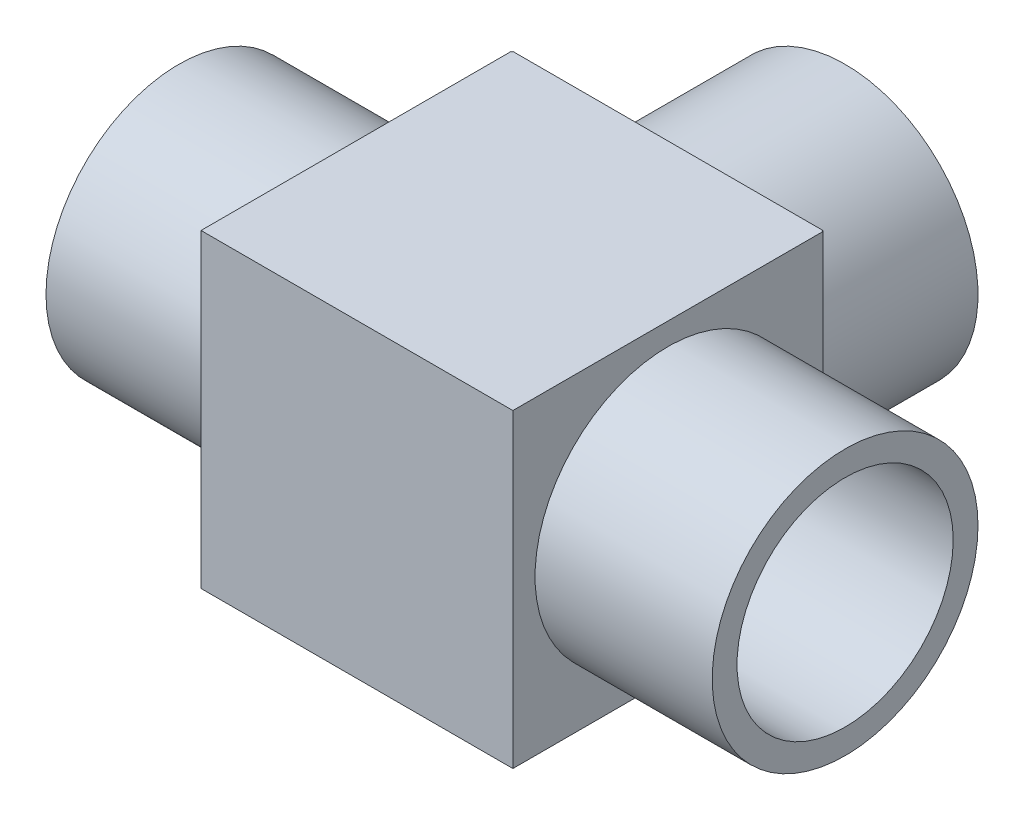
ISO-10303-21;
HEADER;
FILE_DESCRIPTION(('STEP AP214'),'2;1');
FILE_NAME('part.step','',(''),(''),'','','');
FILE_SCHEMA(('AUTOMOTIVE_DESIGN { 1 0 10303 214 1 1 1 1 }'));
ENDSEC;
DATA;
#1=APPLICATION_CONTEXT('core data for automotive mechanical design processes');
#2=APPLICATION_PROTOCOL_DEFINITION('international standard','automotive_design',2000,#1);
#3=PRODUCT_CONTEXT('',#1,'mechanical');
#4=PRODUCT('Part','Part','',(#3));
#5=PRODUCT_RELATED_PRODUCT_CATEGORY('part','',(#4));
#6=PRODUCT_DEFINITION_FORMATION('','',#4);
#7=PRODUCT_DEFINITION_CONTEXT('part definition',#1,'design');
#8=PRODUCT_DEFINITION('design','',#6,#7);
#9=PRODUCT_DEFINITION_SHAPE('','',#8);
#10=(LENGTH_UNIT() NAMED_UNIT(*) SI_UNIT(.MILLI.,.METRE.));
#11=(NAMED_UNIT(*) PLANE_ANGLE_UNIT() SI_UNIT($,.RADIAN.));
#12=(NAMED_UNIT(*) SI_UNIT($,.STERADIAN.) SOLID_ANGLE_UNIT());
#13=UNCERTAINTY_MEASURE_WITH_UNIT(LENGTH_MEASURE(1.E-05),#10,'distance_accuracy_value','');
#14=(GEOMETRIC_REPRESENTATION_CONTEXT(3) GLOBAL_UNCERTAINTY_ASSIGNED_CONTEXT((#13)) GLOBAL_UNIT_ASSIGNED_CONTEXT((#10,
#11,#12)) REPRESENTATION_CONTEXT('',''));
#15=CARTESIAN_POINT('',(0.,0.,0.));
#16=DIRECTION('',(0.,0.,1.));
#17=DIRECTION('',(1.,0.,0.));
#18=AXIS2_PLACEMENT_3D('',#15,#16,#17);
#19=CARTESIAN_POINT('',(6.38175,5.55625,0.));
#20=DIRECTION('',(-1.,0.,0.));
#21=DIRECTION('',(0.,-1.,0.));
#22=AXIS2_PLACEMENT_3D('',#19,#20,#21);
#23=PLANE('',#22);
#24=DIRECTION('',(0.,1.,0.));
#25=VECTOR('',#24,1.);
#26=CARTESIAN_POINT('',(6.38175,5.55625,-5.55625));
#27=LINE('',#26,#25);
#28=CARTESIAN_POINT('',(6.38175,5.55625,-5.55625));
#29=VERTEX_POINT('',#28);
#30=CARTESIAN_POINT('',(6.38175,-5.55625,-5.55625));
#31=VERTEX_POINT('',#30);
#32=EDGE_CURVE('E149',#29,#31,#27,.F.);
#33=ORIENTED_EDGE('',*,*,#32,.F.);
#34=DIRECTION('',(0.,0.,1.));
#35=VECTOR('',#34,1.);
#36=CARTESIAN_POINT('',(6.38175,5.55625,0.));
#37=LINE('',#36,#35);
#38=CARTESIAN_POINT('',(6.38175,5.55625,-5.588));
#39=VERTEX_POINT('',#38);
#40=EDGE_CURVE('E157',#29,#39,#37,.F.);
#41=ORIENTED_EDGE('',*,*,#40,.T.);
#42=DIRECTION('',(0.,1.,0.));
#43=VECTOR('',#42,1.);
#44=CARTESIAN_POINT('',(6.38175,0.,-5.588));
#45=LINE('',#44,#43);
#46=CARTESIAN_POINT('',(6.38175,-5.55625,-5.588));
#47=VERTEX_POINT('',#46);
#48=EDGE_CURVE('E154',#47,#39,#45,.T.);
#49=ORIENTED_EDGE('',*,*,#48,.F.);
#50=DIRECTION('',(0.,0.,1.));
#51=VECTOR('',#50,1.);
#52=CARTESIAN_POINT('',(6.38175,-5.55625,0.));
#53=LINE('',#52,#51);
#54=EDGE_CURVE('E159',#47,#31,#53,.T.);
#55=ORIENTED_EDGE('',*,*,#54,.T.);
#56=EDGE_LOOP('',(#33,#41,#49,#55));
#57=FACE_BOUND('',#56,.T.);
#58=ADVANCED_FACE('F16',(#57),#23,.T.);
#59=CARTESIAN_POINT('',(17.49425,-5.55625,0.));
#60=DIRECTION('',(1.,0.,0.));
#61=DIRECTION('',(0.,1.,0.));
#62=AXIS2_PLACEMENT_3D('',#59,#60,#61);
#63=PLANE('',#62);
#64=DIRECTION('',(0.,1.,0.));
#65=VECTOR('',#64,1.);
#66=CARTESIAN_POINT('',(17.49425,0.,-5.588));
#67=LINE('',#66,#65);
#68=CARTESIAN_POINT('',(17.49425,5.55625,-5.588));
#69=VERTEX_POINT('',#68);
#70=CARTESIAN_POINT('',(17.49425,-5.55625,-5.588));
#71=VERTEX_POINT('',#70);
#72=EDGE_CURVE('E152',#69,#71,#67,.F.);
#73=ORIENTED_EDGE('',*,*,#72,.F.);
#74=DIRECTION('',(0.,0.,1.));
#75=VECTOR('',#74,1.);
#76=CARTESIAN_POINT('',(17.49425,5.55625,5.55625));
#77=LINE('',#76,#75);
#78=CARTESIAN_POINT('',(17.49425,5.55625,-5.55625));
#79=VERTEX_POINT('',#78);
#80=EDGE_CURVE('E145',#79,#69,#77,.F.);
#81=ORIENTED_EDGE('',*,*,#80,.F.);
#82=DIRECTION('',(0.,1.,0.));
#83=VECTOR('',#82,1.);
#84=CARTESIAN_POINT('',(17.49425,5.55625,-5.55625));
#85=LINE('',#84,#83);
#86=CARTESIAN_POINT('',(17.49425,-5.55625,-5.55625));
#87=VERTEX_POINT('',#86);
#88=EDGE_CURVE('E130',#87,#79,#85,.T.);
#89=ORIENTED_EDGE('',*,*,#88,.F.);
#90=DIRECTION('',(0.,0.,1.));
#91=VECTOR('',#90,1.);
#92=CARTESIAN_POINT('',(17.49425,-5.55625,-5.55625));
#93=LINE('',#92,#91);
#94=EDGE_CURVE('E102',#71,#87,#93,.T.);
#95=ORIENTED_EDGE('',*,*,#94,.F.);
#96=EDGE_LOOP('',(#73,#81,#89,#95));
#97=FACE_BOUND('',#96,.T.);
#98=ADVANCED_FACE('F240',(#97),#63,.T.);
#99=CARTESIAN_POINT('',(14.716125,0.,-5.588));
#100=DIRECTION('',(0.,0.,-1.));
#101=DIRECTION('',(-1.,0.,0.));
#102=AXIS2_PLACEMENT_3D('',#99,#100,#101);
#103=PLANE('',#102);
#104=DIRECTION('',(1.,0.,0.));
#105=VECTOR('',#104,1.);
#106=CARTESIAN_POINT('',(6.35,5.55625,-5.588));
#107=LINE('',#106,#105);
#108=EDGE_CURVE('E142',#69,#39,#107,.F.);
#109=ORIENTED_EDGE('',*,*,#108,.F.);
#110=ORIENTED_EDGE('',*,*,#72,.T.);
#111=DIRECTION('',(1.,0.,0.));
#112=VECTOR('',#111,1.);
#113=CARTESIAN_POINT('',(6.35,-5.55625,-5.588));
#114=LINE('',#113,#112);
#115=EDGE_CURVE('E138',#47,#71,#114,.T.);
#116=ORIENTED_EDGE('',*,*,#115,.F.);
#117=ORIENTED_EDGE('',*,*,#48,.T.);
#118=EDGE_LOOP('',(#109,#110,#116,#117));
#119=FACE_BOUND('',#118,.T.);
#120=CARTESIAN_POINT('',(11.938,0.,-5.588));
#121=DIRECTION('',(0.,0.,-1.));
#122=DIRECTION('',(-1.,0.,0.));
#123=AXIS2_PLACEMENT_3D('',#120,#121,#122);
#124=CIRCLE('',#123,4.7625);
#125=CARTESIAN_POINT('',(7.1755,0.,-5.588));
#126=VERTEX_POINT('',#125);
#127=EDGE_CURVE('E19',#126,#126,#124,.T.);
#128=ORIENTED_EDGE('',*,*,#127,.F.);
#129=EDGE_LOOP('',(#128));
#130=FACE_BOUND('',#129,.T.);
#131=ADVANCED_FACE('F237',(#119,#130),#103,.T.);
#132=CARTESIAN_POINT('',(6.35,5.55625,-5.55625));
#133=DIRECTION('',(0.,0.,-1.));
#134=DIRECTION('',(-1.,0.,0.));
#135=AXIS2_PLACEMENT_3D('',#132,#133,#134);
#136=PLANE('',#135);
#137=DIRECTION('',(0.,1.,0.));
#138=VECTOR('',#137,1.);
#139=CARTESIAN_POINT('',(6.35,0.,-5.55625));
#140=LINE('',#139,#138);
#141=CARTESIAN_POINT('',(6.35,5.55625,-5.55625));
#142=VERTEX_POINT('',#141);
#143=CARTESIAN_POINT('',(6.35,-5.55625,-5.55625));
#144=VERTEX_POINT('',#143);
#145=EDGE_CURVE('E117',#142,#144,#140,.F.);
#146=ORIENTED_EDGE('',*,*,#145,.F.);
#147=DIRECTION('',(1.,0.,0.));
#148=VECTOR('',#147,1.);
#149=CARTESIAN_POINT('',(6.35,5.55625,-5.55625));
#150=LINE('',#149,#148);
#151=EDGE_CURVE('E147',#29,#142,#150,.F.);
#152=ORIENTED_EDGE('',*,*,#151,.F.);
#153=ORIENTED_EDGE('',*,*,#32,.T.);
#154=DIRECTION('',(1.,0.,0.));
#155=VECTOR('',#154,1.);
#156=CARTESIAN_POINT('',(6.35,-5.55625,-5.55625));
#157=LINE('',#156,#155);
#158=EDGE_CURVE('E132',#144,#31,#157,.T.);
#159=ORIENTED_EDGE('',*,*,#158,.F.);
#160=EDGE_LOOP('',(#146,#152,#153,#159));
#161=FACE_BOUND('',#160,.T.);
#162=ADVANCED_FACE('F239',(#161),#136,.T.);
#163=CARTESIAN_POINT('',(6.35,5.55625,5.55625));
#164=DIRECTION('',(0.,1.,0.));
#165=DIRECTION('',(0.,0.,1.));
#166=AXIS2_PLACEMENT_3D('',#163,#164,#165);
#167=PLANE('',#166);
#168=ORIENTED_EDGE('',*,*,#108,.T.);
#169=ORIENTED_EDGE('',*,*,#40,.F.);
#170=ORIENTED_EDGE('',*,*,#151,.T.);
#171=DIRECTION('',(0.,0.,1.));
#172=VECTOR('',#171,1.);
#173=CARTESIAN_POINT('',(6.35,5.55625,-2.778125));
#174=LINE('',#173,#172);
#175=CARTESIAN_POINT('',(6.35,5.55625,5.55625));
#176=VERTEX_POINT('',#175);
#177=EDGE_CURVE('E120',#176,#142,#174,.F.);
#178=ORIENTED_EDGE('',*,*,#177,.F.);
#179=DIRECTION('',(1.,0.,0.));
#180=VECTOR('',#179,1.);
#181=CARTESIAN_POINT('',(6.35,5.55625,5.55625));
#182=LINE('',#181,#180);
#183=CARTESIAN_POINT('',(17.526,5.55625,5.55625));
#184=VERTEX_POINT('',#183);
#185=EDGE_CURVE('E140',#184,#176,#182,.F.);
#186=ORIENTED_EDGE('',*,*,#185,.F.);
#187=DIRECTION('',(0.,0.,1.));
#188=VECTOR('',#187,1.);
#189=CARTESIAN_POINT('',(17.526,5.55625,-2.778125));
#190=LINE('',#189,#188);
#191=CARTESIAN_POINT('',(17.526,5.55625,-5.55625));
#192=VERTEX_POINT('',#191);
#193=EDGE_CURVE('E115',#192,#184,#190,.T.);
#194=ORIENTED_EDGE('',*,*,#193,.F.);
#195=DIRECTION('',(-1.,0.,0.));
#196=VECTOR('',#195,1.);
#197=CARTESIAN_POINT('',(6.35,5.55625,-5.55625));
#198=LINE('',#197,#196);
#199=EDGE_CURVE('E105',#79,#192,#198,.F.);
#200=ORIENTED_EDGE('',*,*,#199,.F.);
#201=ORIENTED_EDGE('',*,*,#80,.T.);
#202=EDGE_LOOP('',(#168,#169,#170,#178,#186,#194,#200,#201));
#203=FACE_BOUND('',#202,.T.);
#204=ADVANCED_FACE('F247',(#203),#167,.T.);
#205=CARTESIAN_POINT('',(6.35,-5.55625,5.55625));
#206=DIRECTION('',(0.,0.,1.));
#207=DIRECTION('',(0.,-1.,0.));
#208=AXIS2_PLACEMENT_3D('',#205,#206,#207);
#209=PLANE('',#208);
#210=DIRECTION('',(0.,1.,0.));
#211=VECTOR('',#210,1.);
#212=CARTESIAN_POINT('',(17.526,0.,5.55625));
#213=LINE('',#212,#211);
#214=CARTESIAN_POINT('',(17.526,-5.55625,5.55625));
#215=VERTEX_POINT('',#214);
#216=EDGE_CURVE('E92',#184,#215,#213,.F.);
#217=ORIENTED_EDGE('',*,*,#216,.F.);
#218=ORIENTED_EDGE('',*,*,#185,.T.);
#219=DIRECTION('',(0.,1.,0.));
#220=VECTOR('',#219,1.);
#221=CARTESIAN_POINT('',(6.35,0.,5.55625));
#222=LINE('',#221,#220);
#223=CARTESIAN_POINT('',(6.35,-5.55625,5.55625));
#224=VERTEX_POINT('',#223);
#225=EDGE_CURVE('E123',#224,#176,#222,.T.);
#226=ORIENTED_EDGE('',*,*,#225,.F.);
#227=DIRECTION('',(1.,0.,0.));
#228=VECTOR('',#227,1.);
#229=CARTESIAN_POINT('',(6.35,-5.55625,5.55625));
#230=LINE('',#229,#228);
#231=EDGE_CURVE('E135',#215,#224,#230,.F.);
#232=ORIENTED_EDGE('',*,*,#231,.F.);
#233=EDGE_LOOP('',(#217,#218,#226,#232));
#234=FACE_BOUND('',#233,.T.);
#235=ADVANCED_FACE('F255',(#234),#209,.T.);
#236=CARTESIAN_POINT('',(6.35,-5.55625,-5.55625));
#237=DIRECTION('',(0.,-1.,0.));
#238=DIRECTION('',(1.,0.,0.));
#239=AXIS2_PLACEMENT_3D('',#236,#237,#238);
#240=PLANE('',#239);
#241=DIRECTION('',(0.,0.,1.));
#242=VECTOR('',#241,1.);
#243=CARTESIAN_POINT('',(6.35,-5.55625,-2.778125));
#244=LINE('',#243,#242);
#245=EDGE_CURVE('E126',#144,#224,#244,.T.);
#246=ORIENTED_EDGE('',*,*,#245,.F.);
#247=ORIENTED_EDGE('',*,*,#158,.T.);
#248=ORIENTED_EDGE('',*,*,#54,.F.);
#249=ORIENTED_EDGE('',*,*,#115,.T.);
#250=ORIENTED_EDGE('',*,*,#94,.T.);
#251=DIRECTION('',(-1.,0.,0.));
#252=VECTOR('',#251,1.);
#253=CARTESIAN_POINT('',(6.35,-5.55625,-5.55625));
#254=LINE('',#253,#252);
#255=CARTESIAN_POINT('',(17.526,-5.55625,-5.55625));
#256=VERTEX_POINT('',#255);
#257=EDGE_CURVE('E97',#256,#87,#254,.T.);
#258=ORIENTED_EDGE('',*,*,#257,.F.);
#259=DIRECTION('',(0.,0.,1.));
#260=VECTOR('',#259,1.);
#261=CARTESIAN_POINT('',(17.526,-5.55625,-2.778125));
#262=LINE('',#261,#260);
#263=EDGE_CURVE('E84',#215,#256,#262,.F.);
#264=ORIENTED_EDGE('',*,*,#263,.F.);
#265=ORIENTED_EDGE('',*,*,#231,.T.);
#266=EDGE_LOOP('',(#246,#247,#248,#249,#250,#258,#264,#265));
#267=FACE_BOUND('',#266,.T.);
#268=ADVANCED_FACE('F99',(#267),#240,.T.);
#269=CARTESIAN_POINT('',(6.35,5.55625,-5.55625));
#270=DIRECTION('',(0.,0.,-1.));
#271=DIRECTION('',(-1.,0.,0.));
#272=AXIS2_PLACEMENT_3D('',#269,#270,#271);
#273=PLANE('',#272);
#274=DIRECTION('',(0.,1.,0.));
#275=VECTOR('',#274,1.);
#276=CARTESIAN_POINT('',(17.526,0.,-5.55625));
#277=LINE('',#276,#275);
#278=EDGE_CURVE('E89',#256,#192,#277,.T.);
#279=ORIENTED_EDGE('',*,*,#278,.F.);
#280=ORIENTED_EDGE('',*,*,#257,.T.);
#281=ORIENTED_EDGE('',*,*,#88,.T.);
#282=ORIENTED_EDGE('',*,*,#199,.T.);
#283=EDGE_LOOP('',(#279,#280,#281,#282));
#284=FACE_BOUND('',#283,.T.);
#285=ADVANCED_FACE('F107',(#284),#273,.T.);
#286=CARTESIAN_POINT('',(11.938,0.,-8.763));
#287=DIRECTION('',(0.,0.,-1.));
#288=DIRECTION('',(-1.,0.,0.));
#289=AXIS2_PLACEMENT_3D('',#286,#287,#288);
#290=CYLINDRICAL_SURFACE('',#289,4.7625);
#291=CARTESIAN_POINT('',(11.938,0.,-11.938));
#292=DIRECTION('',(0.,0.,-1.));
#293=DIRECTION('',(-1.,0.,0.));
#294=AXIS2_PLACEMENT_3D('',#291,#292,#293);
#295=CIRCLE('',#294,4.7625);
#296=CARTESIAN_POINT('',(7.1755,0.,-11.938));
#297=VERTEX_POINT('',#296);
#298=EDGE_CURVE('E109',#297,#297,#295,.T.);
#299=ORIENTED_EDGE('',*,*,#298,.F.);
#300=EDGE_LOOP('',(#299));
#301=FACE_BOUND('',#300,.T.);
#302=ORIENTED_EDGE('',*,*,#127,.T.);
#303=EDGE_LOOP('',(#302));
#304=FACE_BOUND('',#303,.T.);
#305=ADVANCED_FACE('F185',(#301,#304),#290,.T.);
#306=CARTESIAN_POINT('',(6.35,0.,-2.778125));
#307=DIRECTION('',(-1.,0.,0.));
#308=DIRECTION('',(0.,0.,1.));
#309=AXIS2_PLACEMENT_3D('',#306,#307,#308);
#310=PLANE('',#309);
#311=ORIENTED_EDGE('',*,*,#177,.T.);
#312=ORIENTED_EDGE('',*,*,#145,.T.);
#313=ORIENTED_EDGE('',*,*,#245,.T.);
#314=ORIENTED_EDGE('',*,*,#225,.T.);
#315=EDGE_LOOP('',(#311,#312,#313,#314));
#316=FACE_BOUND('',#315,.T.);
#317=CARTESIAN_POINT('',(6.35,0.,0.));
#318=DIRECTION('',(-1.,0.,0.));
#319=DIRECTION('',(0.,0.,1.));
#320=AXIS2_PLACEMENT_3D('',#317,#318,#319);
#321=CIRCLE('',#320,4.7625);
#322=CARTESIAN_POINT('',(6.35,0.,4.7625));
#323=VERTEX_POINT('',#322);
#324=EDGE_CURVE('E112',#323,#323,#321,.T.);
#325=ORIENTED_EDGE('',*,*,#324,.F.);
#326=EDGE_LOOP('',(#325));
#327=FACE_BOUND('',#326,.T.);
#328=ADVANCED_FACE('F183',(#316,#327),#310,.T.);
#329=CARTESIAN_POINT('',(17.526,0.,-2.778125));
#330=DIRECTION('',(1.,0.,0.));
#331=DIRECTION('',(0.,1.,0.));
#332=AXIS2_PLACEMENT_3D('',#329,#330,#331);
#333=PLANE('',#332);
#334=ORIENTED_EDGE('',*,*,#263,.T.);
#335=ORIENTED_EDGE('',*,*,#278,.T.);
#336=ORIENTED_EDGE('',*,*,#193,.T.);
#337=ORIENTED_EDGE('',*,*,#216,.T.);
#338=EDGE_LOOP('',(#334,#335,#336,#337));
#339=FACE_BOUND('',#338,.T.);
#340=CARTESIAN_POINT('',(17.526,0.,0.));
#341=DIRECTION('',(1.,0.,0.));
#342=DIRECTION('',(0.,0.,-1.));
#343=AXIS2_PLACEMENT_3D('',#340,#341,#342);
#344=CIRCLE('',#343,4.7625);
#345=CARTESIAN_POINT('',(17.526,0.,-4.7625));
#346=VERTEX_POINT('',#345);
#347=EDGE_CURVE('E175',#346,#346,#344,.T.);
#348=ORIENTED_EDGE('',*,*,#347,.F.);
#349=EDGE_LOOP('',(#348));
#350=FACE_BOUND('',#349,.T.);
#351=ADVANCED_FACE('F86',(#339,#350),#333,.T.);
#352=CARTESIAN_POINT('',(14.31925,0.,-11.938));
#353=DIRECTION('',(0.,0.,-1.));
#354=DIRECTION('',(-1.,0.,0.));
#355=AXIS2_PLACEMENT_3D('',#352,#353,#354);
#356=PLANE('',#355);
#357=ORIENTED_EDGE('',*,*,#298,.T.);
#358=EDGE_LOOP('',(#357));
#359=FACE_BOUND('',#358,.T.);
#360=CARTESIAN_POINT('',(11.938,0.,-11.938));
#361=DIRECTION('',(0.,0.,1.));
#362=DIRECTION('',(1.,0.,0.));
#363=AXIS2_PLACEMENT_3D('',#360,#361,#362);
#364=CIRCLE('',#363,3.8735);
#365=CARTESIAN_POINT('',(15.8115,0.,-11.938));
#366=VERTEX_POINT('',#365);
#367=EDGE_CURVE('E172',#366,#366,#364,.T.);
#368=ORIENTED_EDGE('',*,*,#367,.T.);
#369=EDGE_LOOP('',(#368));
#370=FACE_BOUND('',#369,.T.);
#371=ADVANCED_FACE('F193',(#359,#370),#356,.T.);
#372=CARTESIAN_POINT('',(3.175,0.,0.));
#373=DIRECTION('',(-1.,0.,0.));
#374=DIRECTION('',(0.,0.,1.));
#375=AXIS2_PLACEMENT_3D('',#372,#373,#374);
#376=CYLINDRICAL_SURFACE('',#375,4.7625);
#377=CARTESIAN_POINT('',(0.,0.,0.));
#378=DIRECTION('',(-1.,0.,0.));
#379=DIRECTION('',(0.,0.,1.));
#380=AXIS2_PLACEMENT_3D('',#377,#378,#379);
#381=CIRCLE('',#380,4.7625);
#382=CARTESIAN_POINT('',(0.,0.,4.7625));
#383=VERTEX_POINT('',#382);
#384=EDGE_CURVE('E169',#383,#383,#381,.T.);
#385=ORIENTED_EDGE('',*,*,#384,.F.);
#386=EDGE_LOOP('',(#385));
#387=FACE_BOUND('',#386,.T.);
#388=ORIENTED_EDGE('',*,*,#324,.T.);
#389=EDGE_LOOP('',(#388));
#390=FACE_BOUND('',#389,.T.);
#391=ADVANCED_FACE('F181',(#387,#390),#376,.T.);
#392=CARTESIAN_POINT('',(20.701,0.,0.));
#393=DIRECTION('',(1.,0.,0.));
#394=DIRECTION('',(0.,0.,-1.));
#395=AXIS2_PLACEMENT_3D('',#392,#393,#394);
#396=CYLINDRICAL_SURFACE('',#395,4.7625);
#397=CARTESIAN_POINT('',(23.876,0.,0.));
#398=DIRECTION('',(1.,0.,0.));
#399=DIRECTION('',(0.,0.,-1.));
#400=AXIS2_PLACEMENT_3D('',#397,#398,#399);
#401=CIRCLE('',#400,4.7625);
#402=CARTESIAN_POINT('',(23.876,0.,-4.7625));
#403=VERTEX_POINT('',#402);
#404=EDGE_CURVE('E166',#403,#403,#401,.T.);
#405=ORIENTED_EDGE('',*,*,#404,.F.);
#406=EDGE_LOOP('',(#405));
#407=FACE_BOUND('',#406,.T.);
#408=ORIENTED_EDGE('',*,*,#347,.T.);
#409=EDGE_LOOP('',(#408));
#410=FACE_BOUND('',#409,.T.);
#411=ADVANCED_FACE('F217',(#407,#410),#396,.T.);
#412=CARTESIAN_POINT('',(11.938,0.,-5.969));
#413=DIRECTION('',(0.,0.,1.));
#414=DIRECTION('',(1.,0.,0.));
#415=AXIS2_PLACEMENT_3D('',#412,#413,#414);
#416=CYLINDRICAL_SURFACE('',#415,3.8735);
#417=CARTESIAN_POINT('',(11.938,0.,0.));
#418=DIRECTION('',(-0.707106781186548,0.,0.707106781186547));
#419=DIRECTION('',(0.707106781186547,0.,0.707106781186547));
#420=AXIS2_PLACEMENT_3D('',#417,#418,#419);
#421=ELLIPSE('',#420,5.47795623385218,3.8735);
#422=CARTESIAN_POINT('',(11.938,3.8735,0.));
#423=VERTEX_POINT('',#422);
#424=CARTESIAN_POINT('',(11.938,-3.8735,0.));
#425=VERTEX_POINT('',#424);
#426=EDGE_CURVE('E31',#423,#425,#421,.T.);
#427=ORIENTED_EDGE('',*,*,#426,.T.);
#428=CARTESIAN_POINT('',(11.938,0.,0.));
#429=DIRECTION('',(0.707106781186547,0.,0.707106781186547));
#430=DIRECTION('',(-0.707106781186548,0.,0.707106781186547));
#431=AXIS2_PLACEMENT_3D('',#428,#429,#430);
#432=ELLIPSE('',#431,5.47795623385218,3.8735);
#433=EDGE_CURVE('E164',#425,#423,#432,.T.);
#434=ORIENTED_EDGE('',*,*,#433,.T.);
#435=EDGE_LOOP('',(#427,#434));
#436=FACE_BOUND('',#435,.T.);
#437=ORIENTED_EDGE('',*,*,#367,.F.);
#438=EDGE_LOOP('',(#437));
#439=FACE_BOUND('',#438,.T.);
#440=ADVANCED_FACE('F213',(#436,#439),#416,.F.);
#441=CARTESIAN_POINT('',(0.,0.,-2.38125));
#442=DIRECTION('',(-1.,0.,0.));
#443=DIRECTION('',(0.,0.,1.));
#444=AXIS2_PLACEMENT_3D('',#441,#442,#443);
#445=PLANE('',#444);
#446=ORIENTED_EDGE('',*,*,#384,.T.);
#447=EDGE_LOOP('',(#446));
#448=FACE_BOUND('',#447,.T.);
#449=CARTESIAN_POINT('',(0.,0.,0.));
#450=DIRECTION('',(1.,0.,0.));
#451=DIRECTION('',(0.,0.,-1.));
#452=AXIS2_PLACEMENT_3D('',#449,#450,#451);
#453=CIRCLE('',#452,3.8735);
#454=CARTESIAN_POINT('',(0.,0.,-3.8735));
#455=VERTEX_POINT('',#454);
#456=EDGE_CURVE('E25',#455,#455,#453,.T.);
#457=ORIENTED_EDGE('',*,*,#456,.T.);
#458=EDGE_LOOP('',(#457));
#459=FACE_BOUND('',#458,.T.);
#460=ADVANCED_FACE('F205',(#448,#459),#445,.T.);
#461=CARTESIAN_POINT('',(23.876,0.,2.38125));
#462=DIRECTION('',(1.,0.,0.));
#463=DIRECTION('',(0.,1.,0.));
#464=AXIS2_PLACEMENT_3D('',#461,#462,#463);
#465=PLANE('',#464);
#466=ORIENTED_EDGE('',*,*,#404,.T.);
#467=EDGE_LOOP('',(#466));
#468=FACE_BOUND('',#467,.T.);
#469=CARTESIAN_POINT('',(23.876,0.,0.));
#470=DIRECTION('',(1.,0.,0.));
#471=DIRECTION('',(0.,0.,-1.));
#472=AXIS2_PLACEMENT_3D('',#469,#470,#471);
#473=CIRCLE('',#472,3.8735);
#474=CARTESIAN_POINT('',(23.876,0.,-3.8735));
#475=VERTEX_POINT('',#474);
#476=EDGE_CURVE('E11',#475,#475,#473,.F.);
#477=ORIENTED_EDGE('',*,*,#476,.T.);
#478=EDGE_LOOP('',(#477));
#479=FACE_BOUND('',#478,.T.);
#480=ADVANCED_FACE('F199',(#468,#479),#465,.T.);
#481=CARTESIAN_POINT('',(11.938,0.,0.));
#482=DIRECTION('',(1.,0.,0.));
#483=DIRECTION('',(0.,0.,-1.));
#484=AXIS2_PLACEMENT_3D('',#481,#482,#483);
#485=CYLINDRICAL_SURFACE('',#484,3.8735);
#486=ORIENTED_EDGE('',*,*,#456,.F.);
#487=EDGE_LOOP('',(#486));
#488=FACE_BOUND('',#487,.T.);
#489=ORIENTED_EDGE('',*,*,#476,.F.);
#490=EDGE_LOOP('',(#489));
#491=FACE_BOUND('',#490,.T.);
#492=ORIENTED_EDGE('',*,*,#433,.F.);
#493=ORIENTED_EDGE('',*,*,#426,.F.);
#494=EDGE_LOOP('',(#492,#493));
#495=FACE_BOUND('',#494,.T.);
#496=ADVANCED_FACE('F197',(#488,#491,#495),#485,.F.);
#497=CLOSED_SHELL('',(#58,#98,#131,#162,#204,#235,#268,#285,#305,#328,#351,#371,#391,#411,#440,
#460,#480,#496));
#498=MANIFOLD_SOLID_BREP('B1',#497);
#499=ADVANCED_BREP_SHAPE_REPRESENTATION('',(#18,#498),#14);
#500=SHAPE_DEFINITION_REPRESENTATION(#9,#499);
ENDSEC;
END-ISO-10303-21;
